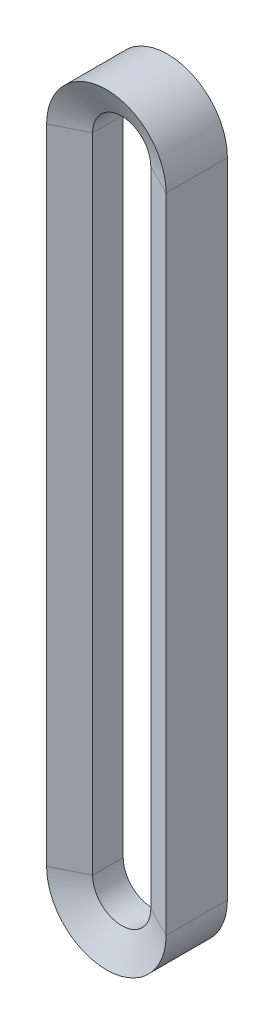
ISO-10303-21;
HEADER;
FILE_DESCRIPTION(('STEP AP214'),'2;1');
FILE_NAME('part.step','',(''),(''),'','','');
FILE_SCHEMA(('AUTOMOTIVE_DESIGN { 1 0 10303 214 1 1 1 1 }'));
ENDSEC;
DATA;
#1=APPLICATION_CONTEXT('core data for automotive mechanical design processes');
#2=APPLICATION_PROTOCOL_DEFINITION('international standard','automotive_design',2000,#1);
#3=PRODUCT_CONTEXT('',#1,'mechanical');
#4=PRODUCT('Part','Part','',(#3));
#5=PRODUCT_RELATED_PRODUCT_CATEGORY('part','',(#4));
#6=PRODUCT_DEFINITION_FORMATION('','',#4);
#7=PRODUCT_DEFINITION_CONTEXT('part definition',#1,'design');
#8=PRODUCT_DEFINITION('design','',#6,#7);
#9=PRODUCT_DEFINITION_SHAPE('','',#8);
#10=(LENGTH_UNIT() NAMED_UNIT(*) SI_UNIT(.MILLI.,.METRE.));
#11=(NAMED_UNIT(*) PLANE_ANGLE_UNIT() SI_UNIT($,.RADIAN.));
#12=(NAMED_UNIT(*) SI_UNIT($,.STERADIAN.) SOLID_ANGLE_UNIT());
#13=UNCERTAINTY_MEASURE_WITH_UNIT(LENGTH_MEASURE(1.E-05),#10,'distance_accuracy_value','');
#14=(GEOMETRIC_REPRESENTATION_CONTEXT(3) GLOBAL_UNCERTAINTY_ASSIGNED_CONTEXT((#13)) GLOBAL_UNIT_ASSIGNED_CONTEXT((#10,
#11,#12)) REPRESENTATION_CONTEXT('',''));
#15=CARTESIAN_POINT('',(0.,0.,0.));
#16=DIRECTION('',(0.,0.,1.));
#17=DIRECTION('',(1.,0.,0.));
#18=AXIS2_PLACEMENT_3D('',#15,#16,#17);
#19=CARTESIAN_POINT('',(0.,-1.11022302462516E-13,-12.7));
#20=DIRECTION('',(0.,0.,-1.));
#21=DIRECTION('',(-1.,0.,0.));
#22=AXIS2_PLACEMENT_3D('',#19,#20,#21);
#23=CONICAL_SURFACE('',#22,24.765,1.10714871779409);
#24=DIRECTION('',(0.894427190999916,0.,0.447213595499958));
#25=VECTOR('',#24,1.);
#26=CARTESIAN_POINT('',(-12.065,0.,-6.35));
#27=LINE('',#26,#25);
#28=CARTESIAN_POINT('',(-24.765,0.,-12.7));
#29=VERTEX_POINT('',#28);
#30=CARTESIAN_POINT('',(-12.065,0.,-6.35));
#31=VERTEX_POINT('',#30);
#32=EDGE_CURVE('E151',#29,#31,#27,.T.);
#33=ORIENTED_EDGE('',*,*,#32,.F.);
#34=CARTESIAN_POINT('',(0.,-1.11022302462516E-13,-12.7));
#35=DIRECTION('',(0.,0.,-1.));
#36=DIRECTION('',(-1.,0.,0.));
#37=AXIS2_PLACEMENT_3D('',#34,#35,#36);
#38=CIRCLE('',#37,24.765);
#39=CARTESIAN_POINT('',(24.765,0.,-12.7));
#40=VERTEX_POINT('',#39);
#41=EDGE_CURVE('E150',#29,#40,#38,.T.);
#42=ORIENTED_EDGE('',*,*,#41,.T.);
#43=DIRECTION('',(-0.894427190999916,0.,0.447213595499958));
#44=VECTOR('',#43,1.);
#45=CARTESIAN_POINT('',(12.065,0.,-6.35));
#46=LINE('',#45,#44);
#47=CARTESIAN_POINT('',(12.065,0.,-6.35));
#48=VERTEX_POINT('',#47);
#49=EDGE_CURVE('E129',#40,#48,#46,.T.);
#50=ORIENTED_EDGE('',*,*,#49,.T.);
#51=CARTESIAN_POINT('',(0.,-1.11022302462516E-13,-6.35));
#52=DIRECTION('',(0.,0.,-1.));
#53=DIRECTION('',(-1.,0.,0.));
#54=AXIS2_PLACEMENT_3D('',#51,#52,#53);
#55=CIRCLE('',#54,12.065);
#56=EDGE_CURVE('E155',#31,#48,#55,.T.);
#57=ORIENTED_EDGE('',*,*,#56,.F.);
#58=EDGE_LOOP('',(#33,#42,#50,#57));
#59=FACE_BOUND('',#58,.T.);
#60=ADVANCED_FACE('F35',(#59),#23,.F.);
#61=CARTESIAN_POINT('',(12.065,0.,-6.35));
#62=DIRECTION('',(0.447213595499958,0.,0.894427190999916));
#63=DIRECTION('',(0.894427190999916,0.,-0.447213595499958));
#64=AXIS2_PLACEMENT_3D('',#61,#62,#63);
#65=PLANE('',#64);
#66=DIRECTION('',(0.,-1.,0.));
#67=VECTOR('',#66,1.);
#68=CARTESIAN_POINT('',(12.065,0.,-6.35));
#69=LINE('',#68,#67);
#70=CARTESIAN_POINT('',(12.065,-266.482137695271,-6.35));
#71=VERTEX_POINT('',#70);
#72=EDGE_CURVE('E119',#48,#71,#69,.T.);
#73=ORIENTED_EDGE('',*,*,#72,.F.);
#74=ORIENTED_EDGE('',*,*,#49,.F.);
#75=DIRECTION('',(0.,-1.,0.));
#76=VECTOR('',#75,1.);
#77=CARTESIAN_POINT('',(24.765,0.,-12.7));
#78=LINE('',#77,#76);
#79=CARTESIAN_POINT('',(24.765,-266.482137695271,-12.7));
#80=VERTEX_POINT('',#79);
#81=EDGE_CURVE('E132',#40,#80,#78,.T.);
#82=ORIENTED_EDGE('',*,*,#81,.T.);
#83=DIRECTION('',(-0.894427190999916,0.,0.447213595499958));
#84=VECTOR('',#83,1.);
#85=CARTESIAN_POINT('',(12.065,-266.482137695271,-6.35));
#86=LINE('',#85,#84);
#87=EDGE_CURVE('E147',#80,#71,#86,.T.);
#88=ORIENTED_EDGE('',*,*,#87,.T.);
#89=EDGE_LOOP('',(#73,#74,#82,#88));
#90=FACE_BOUND('',#89,.T.);
#91=ADVANCED_FACE('F131',(#90),#65,.F.);
#92=CARTESIAN_POINT('',(12.065,0.,6.35));
#93=DIRECTION('',(1.,0.,0.));
#94=DIRECTION('',(0.,0.,-1.));
#95=AXIS2_PLACEMENT_3D('',#92,#93,#94);
#96=PLANE('',#95);
#97=DIRECTION('',(0.,-1.,0.));
#98=VECTOR('',#97,1.);
#99=CARTESIAN_POINT('',(12.065,0.,6.35));
#100=LINE('',#99,#98);
#101=CARTESIAN_POINT('',(12.065,0.,6.35));
#102=VERTEX_POINT('',#101);
#103=CARTESIAN_POINT('',(12.065,-266.482137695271,6.35));
#104=VERTEX_POINT('',#103);
#105=EDGE_CURVE('E113',#102,#104,#100,.T.);
#106=ORIENTED_EDGE('',*,*,#105,.F.);
#107=DIRECTION('',(0.,0.,1.));
#108=VECTOR('',#107,1.);
#109=CARTESIAN_POINT('',(12.065,0.,6.35));
#110=LINE('',#109,#108);
#111=EDGE_CURVE('E137',#48,#102,#110,.T.);
#112=ORIENTED_EDGE('',*,*,#111,.F.);
#113=ORIENTED_EDGE('',*,*,#72,.T.);
#114=DIRECTION('',(0.,0.,1.));
#115=VECTOR('',#114,1.);
#116=CARTESIAN_POINT('',(12.065,-266.482137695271,6.35));
#117=LINE('',#116,#115);
#118=EDGE_CURVE('E195',#71,#104,#117,.T.);
#119=ORIENTED_EDGE('',*,*,#118,.T.);
#120=EDGE_LOOP('',(#106,#112,#113,#119));
#121=FACE_BOUND('',#120,.T.);
#122=ADVANCED_FACE('F214',(#121),#96,.F.);
#123=CARTESIAN_POINT('',(24.765,0.,12.7));
#124=DIRECTION('',(0.447213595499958,0.,-0.894427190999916));
#125=DIRECTION('',(-0.894427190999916,0.,-0.447213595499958));
#126=AXIS2_PLACEMENT_3D('',#123,#124,#125);
#127=PLANE('',#126);
#128=DIRECTION('',(0.,-1.,0.));
#129=VECTOR('',#128,1.);
#130=CARTESIAN_POINT('',(24.765,0.,12.7));
#131=LINE('',#130,#129);
#132=CARTESIAN_POINT('',(24.765,0.,12.7));
#133=VERTEX_POINT('',#132);
#134=CARTESIAN_POINT('',(24.765,-266.482137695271,12.7));
#135=VERTEX_POINT('',#134);
#136=EDGE_CURVE('E165',#133,#135,#131,.T.);
#137=ORIENTED_EDGE('',*,*,#136,.F.);
#138=DIRECTION('',(0.894427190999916,0.,0.447213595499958));
#139=VECTOR('',#138,1.);
#140=CARTESIAN_POINT('',(24.765,0.,12.7));
#141=LINE('',#140,#139);
#142=EDGE_CURVE('E158',#102,#133,#141,.T.);
#143=ORIENTED_EDGE('',*,*,#142,.F.);
#144=ORIENTED_EDGE('',*,*,#105,.T.);
#145=DIRECTION('',(0.894427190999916,0.,0.447213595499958));
#146=VECTOR('',#145,1.);
#147=CARTESIAN_POINT('',(24.765,-266.482137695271,12.7));
#148=LINE('',#147,#146);
#149=EDGE_CURVE('E183',#104,#135,#148,.T.);
#150=ORIENTED_EDGE('',*,*,#149,.T.);
#151=EDGE_LOOP('',(#137,#143,#144,#150));
#152=FACE_BOUND('',#151,.T.);
#153=ADVANCED_FACE('F182',(#152),#127,.F.);
#154=CARTESIAN_POINT('',(24.765,0.,-12.7));
#155=DIRECTION('',(-1.,0.,0.));
#156=DIRECTION('',(0.,0.,1.));
#157=AXIS2_PLACEMENT_3D('',#154,#155,#156);
#158=PLANE('',#157);
#159=DIRECTION('',(0.,0.,-1.));
#160=VECTOR('',#159,1.);
#161=CARTESIAN_POINT('',(24.765,-266.482137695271,-12.7));
#162=LINE('',#161,#160);
#163=EDGE_CURVE('E145',#135,#80,#162,.T.);
#164=ORIENTED_EDGE('',*,*,#163,.T.);
#165=ORIENTED_EDGE('',*,*,#81,.F.);
#166=DIRECTION('',(0.,0.,-1.));
#167=VECTOR('',#166,1.);
#168=CARTESIAN_POINT('',(24.765,0.,-12.7));
#169=LINE('',#168,#167);
#170=EDGE_CURVE('E144',#133,#40,#169,.T.);
#171=ORIENTED_EDGE('',*,*,#170,.F.);
#172=ORIENTED_EDGE('',*,*,#136,.T.);
#173=EDGE_LOOP('',(#164,#165,#171,#172));
#174=FACE_BOUND('',#173,.T.);
#175=ADVANCED_FACE('F142',(#174),#158,.F.);
#176=CARTESIAN_POINT('',(0.,-266.482137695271,-12.7));
#177=DIRECTION('',(0.,0.,-1.));
#178=DIRECTION('',(-1.,0.,0.));
#179=AXIS2_PLACEMENT_3D('',#176,#177,#178);
#180=CONICAL_SURFACE('',#179,24.765,1.10714871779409);
#181=CARTESIAN_POINT('',(0.,-266.482137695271,-6.35));
#182=DIRECTION('',(0.,0.,-1.));
#183=DIRECTION('',(1.,0.,0.));
#184=AXIS2_PLACEMENT_3D('',#181,#182,#183);
#185=CIRCLE('',#184,12.065);
#186=CARTESIAN_POINT('',(-12.065,-266.482137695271,-6.35));
#187=VERTEX_POINT('',#186);
#188=EDGE_CURVE('E100',#71,#187,#185,.T.);
#189=ORIENTED_EDGE('',*,*,#188,.F.);
#190=ORIENTED_EDGE('',*,*,#87,.F.);
#191=CARTESIAN_POINT('',(0.,-266.482137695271,-12.7));
#192=DIRECTION('',(0.,0.,-1.));
#193=DIRECTION('',(1.,0.,0.));
#194=AXIS2_PLACEMENT_3D('',#191,#192,#193);
#195=CIRCLE('',#194,24.765);
#196=CARTESIAN_POINT('',(-24.765,-266.482137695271,-12.7));
#197=VERTEX_POINT('',#196);
#198=EDGE_CURVE('E164',#80,#197,#195,.T.);
#199=ORIENTED_EDGE('',*,*,#198,.T.);
#200=DIRECTION('',(0.894427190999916,0.,0.447213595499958));
#201=VECTOR('',#200,1.);
#202=CARTESIAN_POINT('',(-12.065,-266.482137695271,-6.35));
#203=LINE('',#202,#201);
#204=EDGE_CURVE('E205',#197,#187,#203,.T.);
#205=ORIENTED_EDGE('',*,*,#204,.T.);
#206=EDGE_LOOP('',(#189,#190,#199,#205));
#207=FACE_BOUND('',#206,.T.);
#208=ADVANCED_FACE('F210',(#207),#180,.F.);
#209=CARTESIAN_POINT('',(0.,-266.482137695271,0.));
#210=DIRECTION('',(0.,0.,-1.));
#211=DIRECTION('',(-1.,0.,0.));
#212=AXIS2_PLACEMENT_3D('',#209,#210,#211);
#213=CYLINDRICAL_SURFACE('',#212,12.065);
#214=CARTESIAN_POINT('',(0.,-266.482137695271,6.35));
#215=DIRECTION('',(0.,0.,-1.));
#216=DIRECTION('',(1.,0.,0.));
#217=AXIS2_PLACEMENT_3D('',#214,#215,#216);
#218=CIRCLE('',#217,12.065);
#219=CARTESIAN_POINT('',(-12.065,-266.482137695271,6.35));
#220=VERTEX_POINT('',#219);
#221=EDGE_CURVE('E93',#104,#220,#218,.T.);
#222=ORIENTED_EDGE('',*,*,#221,.F.);
#223=ORIENTED_EDGE('',*,*,#118,.F.);
#224=ORIENTED_EDGE('',*,*,#188,.T.);
#225=DIRECTION('',(0.,0.,1.));
#226=VECTOR('',#225,1.);
#227=CARTESIAN_POINT('',(-12.065,-266.482137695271,6.35));
#228=LINE('',#227,#226);
#229=EDGE_CURVE('E192',#187,#220,#228,.T.);
#230=ORIENTED_EDGE('',*,*,#229,.T.);
#231=EDGE_LOOP('',(#222,#223,#224,#230));
#232=FACE_BOUND('',#231,.T.);
#233=ADVANCED_FACE('F213',(#232),#213,.F.);
#234=CARTESIAN_POINT('',(0.,-266.482137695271,6.35));
#235=DIRECTION('',(0.,0.,1.));
#236=DIRECTION('',(1.,0.,0.));
#237=AXIS2_PLACEMENT_3D('',#234,#235,#236);
#238=CONICAL_SURFACE('',#237,12.065,1.10714871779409);
#239=CARTESIAN_POINT('',(0.,-266.482137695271,12.7));
#240=DIRECTION('',(0.,0.,-1.));
#241=DIRECTION('',(1.,0.,0.));
#242=AXIS2_PLACEMENT_3D('',#239,#240,#241);
#243=CIRCLE('',#242,24.765);
#244=CARTESIAN_POINT('',(-24.765,-266.482137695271,12.7));
#245=VERTEX_POINT('',#244);
#246=EDGE_CURVE('E84',#135,#245,#243,.T.);
#247=ORIENTED_EDGE('',*,*,#246,.F.);
#248=ORIENTED_EDGE('',*,*,#149,.F.);
#249=ORIENTED_EDGE('',*,*,#221,.T.);
#250=DIRECTION('',(-0.894427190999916,0.,0.447213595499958));
#251=VECTOR('',#250,1.);
#252=CARTESIAN_POINT('',(-24.765,-266.482137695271,12.7));
#253=LINE('',#252,#251);
#254=EDGE_CURVE('E170',#220,#245,#253,.T.);
#255=ORIENTED_EDGE('',*,*,#254,.T.);
#256=EDGE_LOOP('',(#247,#248,#249,#255));
#257=FACE_BOUND('',#256,.T.);
#258=ADVANCED_FACE('F232',(#257),#238,.F.);
#259=CARTESIAN_POINT('',(0.,-266.482137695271,0.));
#260=DIRECTION('',(0.,0.,-1.));
#261=DIRECTION('',(-1.,0.,0.));
#262=AXIS2_PLACEMENT_3D('',#259,#260,#261);
#263=CYLINDRICAL_SURFACE('',#262,24.765);
#264=DIRECTION('',(0.,0.,-1.));
#265=VECTOR('',#264,1.);
#266=CARTESIAN_POINT('',(-24.765,-266.482137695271,-12.7));
#267=LINE('',#266,#265);
#268=EDGE_CURVE('E166',#245,#197,#267,.T.);
#269=ORIENTED_EDGE('',*,*,#268,.T.);
#270=ORIENTED_EDGE('',*,*,#198,.F.);
#271=ORIENTED_EDGE('',*,*,#163,.F.);
#272=ORIENTED_EDGE('',*,*,#246,.T.);
#273=EDGE_LOOP('',(#269,#270,#271,#272));
#274=FACE_BOUND('',#273,.T.);
#275=ADVANCED_FACE('F224',(#274),#263,.T.);
#276=CARTESIAN_POINT('',(-12.065,-266.482137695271,-6.35));
#277=DIRECTION('',(-0.447213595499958,0.,0.894427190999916));
#278=DIRECTION('',(0.894427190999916,0.,0.447213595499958));
#279=AXIS2_PLACEMENT_3D('',#276,#277,#278);
#280=PLANE('',#279);
#281=DIRECTION('',(0.,1.,0.));
#282=VECTOR('',#281,1.);
#283=CARTESIAN_POINT('',(-12.065,-266.482137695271,-6.35));
#284=LINE('',#283,#282);
#285=EDGE_CURVE('E190',#187,#31,#284,.T.);
#286=ORIENTED_EDGE('',*,*,#285,.F.);
#287=ORIENTED_EDGE('',*,*,#204,.F.);
#288=DIRECTION('',(0.,1.,0.));
#289=VECTOR('',#288,1.);
#290=CARTESIAN_POINT('',(-24.765,-266.482137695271,-12.7));
#291=LINE('',#290,#289);
#292=EDGE_CURVE('E167',#197,#29,#291,.T.);
#293=ORIENTED_EDGE('',*,*,#292,.T.);
#294=ORIENTED_EDGE('',*,*,#32,.T.);
#295=EDGE_LOOP('',(#286,#287,#293,#294));
#296=FACE_BOUND('',#295,.T.);
#297=ADVANCED_FACE('F222',(#296),#280,.F.);
#298=CARTESIAN_POINT('',(-12.065,-266.482137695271,6.35));
#299=DIRECTION('',(-1.,0.,0.));
#300=DIRECTION('',(0.,0.,1.));
#301=AXIS2_PLACEMENT_3D('',#298,#299,#300);
#302=PLANE('',#301);
#303=DIRECTION('',(0.,1.,0.));
#304=VECTOR('',#303,1.);
#305=CARTESIAN_POINT('',(-12.065,-266.482137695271,6.35));
#306=LINE('',#305,#304);
#307=CARTESIAN_POINT('',(-12.065,0.,6.35));
#308=VERTEX_POINT('',#307);
#309=EDGE_CURVE('E60',#220,#308,#306,.T.);
#310=ORIENTED_EDGE('',*,*,#309,.F.);
#311=ORIENTED_EDGE('',*,*,#229,.F.);
#312=ORIENTED_EDGE('',*,*,#285,.T.);
#313=DIRECTION('',(0.,0.,1.));
#314=VECTOR('',#313,1.);
#315=CARTESIAN_POINT('',(-12.065,0.,6.35));
#316=LINE('',#315,#314);
#317=EDGE_CURVE('E188',#31,#308,#316,.T.);
#318=ORIENTED_EDGE('',*,*,#317,.T.);
#319=EDGE_LOOP('',(#310,#311,#312,#318));
#320=FACE_BOUND('',#319,.T.);
#321=ADVANCED_FACE('F219',(#320),#302,.F.);
#322=CARTESIAN_POINT('',(-24.765,-266.482137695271,12.7));
#323=DIRECTION('',(-0.447213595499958,0.,-0.894427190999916));
#324=DIRECTION('',(-0.894427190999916,0.,0.447213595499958));
#325=AXIS2_PLACEMENT_3D('',#322,#323,#324);
#326=PLANE('',#325);
#327=DIRECTION('',(0.,1.,0.));
#328=VECTOR('',#327,1.);
#329=CARTESIAN_POINT('',(-24.765,-266.482137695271,12.7));
#330=LINE('',#329,#328);
#331=CARTESIAN_POINT('',(-24.765,0.,12.7));
#332=VERTEX_POINT('',#331);
#333=EDGE_CURVE('E52',#245,#332,#330,.T.);
#334=ORIENTED_EDGE('',*,*,#333,.F.);
#335=ORIENTED_EDGE('',*,*,#254,.F.);
#336=ORIENTED_EDGE('',*,*,#309,.T.);
#337=DIRECTION('',(-0.894427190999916,0.,0.447213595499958));
#338=VECTOR('',#337,1.);
#339=CARTESIAN_POINT('',(-24.765,0.,12.7));
#340=LINE('',#339,#338);
#341=EDGE_CURVE('E175',#308,#332,#340,.T.);
#342=ORIENTED_EDGE('',*,*,#341,.T.);
#343=EDGE_LOOP('',(#334,#335,#336,#342));
#344=FACE_BOUND('',#343,.T.);
#345=ADVANCED_FACE('F230',(#344),#326,.F.);
#346=CARTESIAN_POINT('',(-24.765,-266.482137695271,-12.7));
#347=DIRECTION('',(1.,0.,0.));
#348=DIRECTION('',(0.,0.,-1.));
#349=AXIS2_PLACEMENT_3D('',#346,#347,#348);
#350=PLANE('',#349);
#351=DIRECTION('',(0.,0.,-1.));
#352=VECTOR('',#351,1.);
#353=CARTESIAN_POINT('',(-24.765,0.,-12.7));
#354=LINE('',#353,#352);
#355=EDGE_CURVE('E39',#332,#29,#354,.T.);
#356=ORIENTED_EDGE('',*,*,#355,.T.);
#357=ORIENTED_EDGE('',*,*,#292,.F.);
#358=ORIENTED_EDGE('',*,*,#268,.F.);
#359=ORIENTED_EDGE('',*,*,#333,.T.);
#360=EDGE_LOOP('',(#356,#357,#358,#359));
#361=FACE_BOUND('',#360,.T.);
#362=ADVANCED_FACE('F176',(#361),#350,.F.);
#363=CARTESIAN_POINT('',(0.,-1.11022302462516E-13,0.));
#364=DIRECTION('',(0.,0.,-1.));
#365=DIRECTION('',(-1.,0.,0.));
#366=AXIS2_PLACEMENT_3D('',#363,#364,#365);
#367=CYLINDRICAL_SURFACE('',#366,12.065);
#368=ORIENTED_EDGE('',*,*,#56,.T.);
#369=ORIENTED_EDGE('',*,*,#111,.T.);
#370=CARTESIAN_POINT('',(0.,-1.11022302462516E-13,6.35));
#371=DIRECTION('',(0.,0.,-1.));
#372=DIRECTION('',(-1.,0.,0.));
#373=AXIS2_PLACEMENT_3D('',#370,#371,#372);
#374=CIRCLE('',#373,12.065);
#375=EDGE_CURVE('E44',#308,#102,#374,.T.);
#376=ORIENTED_EDGE('',*,*,#375,.F.);
#377=ORIENTED_EDGE('',*,*,#317,.F.);
#378=EDGE_LOOP('',(#368,#369,#376,#377));
#379=FACE_BOUND('',#378,.T.);
#380=ADVANCED_FACE('F216',(#379),#367,.F.);
#381=CARTESIAN_POINT('',(0.,-1.11022302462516E-13,6.35));
#382=DIRECTION('',(0.,0.,1.));
#383=DIRECTION('',(1.,0.,0.));
#384=AXIS2_PLACEMENT_3D('',#381,#382,#383);
#385=CONICAL_SURFACE('',#384,12.065,1.10714871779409);
#386=ORIENTED_EDGE('',*,*,#375,.T.);
#387=ORIENTED_EDGE('',*,*,#142,.T.);
#388=CARTESIAN_POINT('',(0.,-1.11022302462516E-13,12.7));
#389=DIRECTION('',(0.,0.,-1.));
#390=DIRECTION('',(-1.,0.,0.));
#391=AXIS2_PLACEMENT_3D('',#388,#389,#390);
#392=CIRCLE('',#391,24.765);
#393=EDGE_CURVE('E11',#332,#133,#392,.T.);
#394=ORIENTED_EDGE('',*,*,#393,.F.);
#395=ORIENTED_EDGE('',*,*,#341,.F.);
#396=EDGE_LOOP('',(#386,#387,#394,#395));
#397=FACE_BOUND('',#396,.T.);
#398=ADVANCED_FACE('F180',(#397),#385,.F.);
#399=CARTESIAN_POINT('',(0.,-1.11022302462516E-13,0.));
#400=DIRECTION('',(0.,0.,-1.));
#401=DIRECTION('',(-1.,0.,0.));
#402=AXIS2_PLACEMENT_3D('',#399,#400,#401);
#403=CYLINDRICAL_SURFACE('',#402,24.765);
#404=ORIENTED_EDGE('',*,*,#393,.T.);
#405=ORIENTED_EDGE('',*,*,#170,.T.);
#406=ORIENTED_EDGE('',*,*,#41,.F.);
#407=ORIENTED_EDGE('',*,*,#355,.F.);
#408=EDGE_LOOP('',(#404,#405,#406,#407));
#409=FACE_BOUND('',#408,.T.);
#410=ADVANCED_FACE('F37',(#409),#403,.T.);
#411=CLOSED_SHELL('',(#60,#91,#122,#153,#175,#208,#233,#258,#275,#297,#321,#345,#362,#380,#398,#410));
#412=MANIFOLD_SOLID_BREP('B2',#411);
#413=ADVANCED_BREP_SHAPE_REPRESENTATION('',(#18,#412),#14);
#414=SHAPE_DEFINITION_REPRESENTATION(#9,#413);
ENDSEC;
END-ISO-10303-21;
